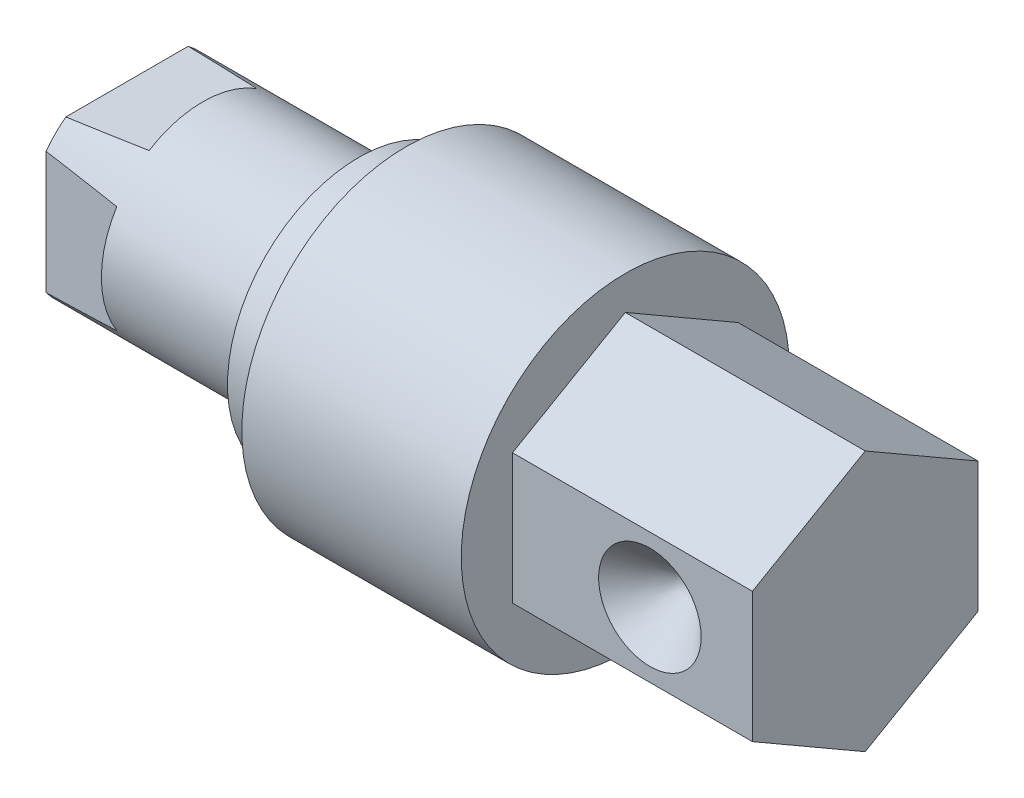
ISO-10303-21;
HEADER;
FILE_DESCRIPTION(('STEP AP214'),'2;1');
FILE_NAME('part.step','',(''),(''),'','','');
FILE_SCHEMA(('AUTOMOTIVE_DESIGN { 1 0 10303 214 1 1 1 1 }'));
ENDSEC;
DATA;
#1=APPLICATION_CONTEXT('core data for automotive mechanical design processes');
#2=APPLICATION_PROTOCOL_DEFINITION('international standard','automotive_design',2000,#1);
#3=PRODUCT_CONTEXT('',#1,'mechanical');
#4=PRODUCT('Part','Part','',(#3));
#5=PRODUCT_RELATED_PRODUCT_CATEGORY('part','',(#4));
#6=PRODUCT_DEFINITION_FORMATION('','',#4);
#7=PRODUCT_DEFINITION_CONTEXT('part definition',#1,'design');
#8=PRODUCT_DEFINITION('design','',#6,#7);
#9=PRODUCT_DEFINITION_SHAPE('','',#8);
#10=(LENGTH_UNIT() NAMED_UNIT(*) SI_UNIT(.MILLI.,.METRE.));
#11=(NAMED_UNIT(*) PLANE_ANGLE_UNIT() SI_UNIT($,.RADIAN.));
#12=(NAMED_UNIT(*) SI_UNIT($,.STERADIAN.) SOLID_ANGLE_UNIT());
#13=UNCERTAINTY_MEASURE_WITH_UNIT(LENGTH_MEASURE(1.E-05),#10,'distance_accuracy_value','');
#14=(GEOMETRIC_REPRESENTATION_CONTEXT(3) GLOBAL_UNCERTAINTY_ASSIGNED_CONTEXT((#13)) GLOBAL_UNIT_ASSIGNED_CONTEXT((#10,
#11,#12)) REPRESENTATION_CONTEXT('',''));
#15=CARTESIAN_POINT('',(0.,0.,0.));
#16=DIRECTION('',(0.,0.,1.));
#17=DIRECTION('',(1.,0.,0.));
#18=AXIS2_PLACEMENT_3D('',#15,#16,#17);
#19=CARTESIAN_POINT('',(-13.6,0.,0.));
#20=DIRECTION('',(-1.,0.,0.));
#21=DIRECTION('',(0.,0.,1.));
#22=AXIS2_PLACEMENT_3D('',#19,#20,#21);
#23=CYLINDRICAL_SURFACE('',#22,3.);
#24=CARTESIAN_POINT('',(-3.6,0.,0.));
#25=DIRECTION('',(-1.,0.,0.));
#26=DIRECTION('',(0.,0.,1.));
#27=AXIS2_PLACEMENT_3D('',#24,#25,#26);
#28=CIRCLE('',#27,3.);
#29=CARTESIAN_POINT('',(-3.6,0.,3.));
#30=VERTEX_POINT('',#29);
#31=EDGE_CURVE('P0_E11',#30,#30,#28,.T.);
#32=ORIENTED_EDGE('',*,*,#31,.T.);
#33=EDGE_LOOP('',(#32));
#34=FACE_BOUND('',#33,.T.);
#35=CARTESIAN_POINT('',(-13.6,0.,0.));
#36=DIRECTION('',(-1.,0.,0.));
#37=DIRECTION('',(0.,0.,1.));
#38=AXIS2_PLACEMENT_3D('',#35,#36,#37);
#39=CIRCLE('',#38,3.);
#40=CARTESIAN_POINT('',(-13.6,0.,3.));
#41=VERTEX_POINT('',#40);
#42=EDGE_CURVE('P0_E23',#41,#41,#39,.F.);
#43=ORIENTED_EDGE('',*,*,#42,.T.);
#44=EDGE_LOOP('',(#43));
#45=FACE_BOUND('',#44,.T.);
#46=ADVANCED_FACE('P0_F16',(#34,#45),#23,.T.);
#47=CARTESIAN_POINT('',(-3.6,0.,0.));
#48=DIRECTION('',(-1.,0.,0.));
#49=DIRECTION('',(0.,0.,1.));
#50=AXIS2_PLACEMENT_3D('',#47,#48,#49);
#51=PLANE('',#50);
#52=CARTESIAN_POINT('',(-3.6,-2.5,0.));
#53=CARTESIAN_POINT('',(-3.6,-2.49841699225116,-0.500094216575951));
#54=CARTESIAN_POINT('',(-3.6,-2.3097253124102,-0.956496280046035));
#55=CARTESIAN_POINT('',(-3.6,-2.12006183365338,-1.41524890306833));
#56=CARTESIAN_POINT('',(-3.6,-1.76775992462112,-1.7677269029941));
#57=CARTESIAN_POINT('',(-3.6,-1.41648835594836,-2.11917404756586));
#58=CARTESIAN_POINT('',(-3.6,-0.956706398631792,-2.30968776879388));
#59=CARTESIAN_POINT('',(-3.6,-0.497671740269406,-2.499891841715));
#60=CARTESIAN_POINT('',(-3.6,0.,-2.49999999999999));
#61=CARTESIAN_POINT('',(-3.6,0.496587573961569,-2.50010792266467));
#62=CARTESIAN_POINT('',(-3.6,0.956706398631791,-2.30968776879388));
#63=CARTESIAN_POINT('',(-3.6,1.41557313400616,-2.11978579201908));
#64=CARTESIAN_POINT('',(-3.6,1.76775992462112,-1.7677269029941));
#65=CARTESIAN_POINT('',(-3.6,2.11945156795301,-1.41616298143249));
#66=CARTESIAN_POINT('',(-3.6,2.30972531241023,-0.956496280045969));
#67=CARTESIAN_POINT('',(-3.6,2.4984152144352,-0.500655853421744));
#68=CARTESIAN_POINT('',(-3.6,2.5,0.));
#69=B_SPLINE_CURVE_WITH_KNOTS('',2,(#52,#53,#54,#55,#56,#57,#58,#59,#60,#61,#62,#63,#64,#65,#66,
#67,#68),.UNSPECIFIED.,.F.,.F.,(3,2,2,2,2,2,2,2,3),(0.,0.125,0.25,0.375,0.5,0.625,0.75,0.875,
1.),.UNSPECIFIED.);
#70=CARTESIAN_POINT('',(-3.6,-2.5,0.));
#71=VERTEX_POINT('',#70);
#72=CARTESIAN_POINT('',(-3.6,2.5,0.));
#73=VERTEX_POINT('',#72);
#74=EDGE_CURVE('P0_E27',#71,#73,#69,.T.);
#75=ORIENTED_EDGE('',*,*,#74,.F.);
#76=CARTESIAN_POINT('',(-3.6,2.5,0.));
#77=CARTESIAN_POINT('',(-3.6,2.49841699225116,0.500094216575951));
#78=CARTESIAN_POINT('',(-3.6,2.3097253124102,0.956496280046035));
#79=CARTESIAN_POINT('',(-3.6,2.12006183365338,1.41524890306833));
#80=CARTESIAN_POINT('',(-3.6,1.76775992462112,1.7677269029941));
#81=CARTESIAN_POINT('',(-3.6,1.41648835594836,2.11917404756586));
#82=CARTESIAN_POINT('',(-3.6,0.956706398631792,2.30968776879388));
#83=CARTESIAN_POINT('',(-3.6,0.497671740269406,2.499891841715));
#84=CARTESIAN_POINT('',(-3.6,0.,2.49999999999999));
#85=CARTESIAN_POINT('',(-3.6,-0.496587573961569,2.50010792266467));
#86=CARTESIAN_POINT('',(-3.6,-0.956706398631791,2.30968776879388));
#87=CARTESIAN_POINT('',(-3.6,-1.41557313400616,2.11978579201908));
#88=CARTESIAN_POINT('',(-3.6,-1.76775992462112,1.7677269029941));
#89=CARTESIAN_POINT('',(-3.6,-2.11945156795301,1.41616298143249));
#90=CARTESIAN_POINT('',(-3.6,-2.30972531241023,0.956496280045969));
#91=CARTESIAN_POINT('',(-3.6,-2.4984152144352,0.500655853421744));
#92=CARTESIAN_POINT('',(-3.6,-2.5,0.));
#93=B_SPLINE_CURVE_WITH_KNOTS('',2,(#76,#77,#78,#79,#80,#81,#82,#83,#84,#85,#86,#87,#88,#89,#90,
#91,#92),.UNSPECIFIED.,.F.,.F.,(3,2,2,2,2,2,2,2,3),(0.,0.125,0.25,0.375,0.5,0.625,0.75,0.875,
1.),.UNSPECIFIED.);
#94=EDGE_CURVE('P0_E32',#73,#71,#93,.T.);
#95=ORIENTED_EDGE('',*,*,#94,.F.);
#96=EDGE_LOOP('',(#75,#95));
#97=FACE_BOUND('',#96,.T.);
#98=ORIENTED_EDGE('',*,*,#31,.F.);
#99=EDGE_LOOP('',(#98));
#100=FACE_BOUND('',#99,.T.);
#101=ADVANCED_FACE('P0_F17',(#97,#100),#51,.F.);
#102=OPEN_SHELL('',(#46,#101));
#103=SHELL_BASED_SURFACE_MODEL('P0_B1',(#102));
#104=CARTESIAN_POINT('',(1.4,0.,0.));
#105=DIRECTION('',(1.,0.,0.));
#106=DIRECTION('',(0.,0.,-1.));
#107=AXIS2_PLACEMENT_3D('',#104,#105,#106);
#108=PLANE('',#107);
#109=CARTESIAN_POINT('',(1.4,0.,0.));
#110=DIRECTION('',(1.,0.,0.));
#111=DIRECTION('',(0.,0.,-1.));
#112=AXIS2_PLACEMENT_3D('',#109,#110,#111);
#113=CIRCLE('',#112,2.5);
#114=CARTESIAN_POINT('',(1.4,0.,-2.5));
#115=VERTEX_POINT('',#114);
#116=EDGE_CURVE('P1_E19',#115,#115,#113,.F.);
#117=ORIENTED_EDGE('',*,*,#116,.T.);
#118=EDGE_LOOP('',(#117));
#119=FACE_BOUND('',#118,.T.);
#120=ADVANCED_FACE('P1_F16',(#119),#108,.F.);
#121=CARTESIAN_POINT('',(-13.6,0.,0.));
#122=DIRECTION('',(1.,0.,0.));
#123=DIRECTION('',(0.,0.,-1.));
#124=AXIS2_PLACEMENT_3D('',#121,#122,#123);
#125=CYLINDRICAL_SURFACE('',#124,2.5);
#126=ORIENTED_EDGE('',*,*,#116,.F.);
#127=EDGE_LOOP('',(#126));
#128=FACE_BOUND('',#127,.T.);
#129=CARTESIAN_POINT('',(-13.6,0.,0.));
#130=DIRECTION('',(1.,0.,0.));
#131=DIRECTION('',(0.,0.,-1.));
#132=AXIS2_PLACEMENT_3D('',#129,#130,#131);
#133=CIRCLE('',#132,2.5);
#134=CARTESIAN_POINT('',(-13.6,0.,-2.5));
#135=VERTEX_POINT('',#134);
#136=EDGE_CURVE('P1_E165',#135,#135,#133,.F.);
#137=ORIENTED_EDGE('',*,*,#136,.T.);
#138=EDGE_LOOP('',(#137));
#139=FACE_BOUND('',#138,.T.);
#140=ADVANCED_FACE('P1_F377',(#128,#139),#125,.F.);
#141=CARTESIAN_POINT('',(-13.6,0.,0.));
#142=DIRECTION('',(1.,0.,0.));
#143=DIRECTION('',(0.,0.,-1.));
#144=AXIS2_PLACEMENT_3D('',#141,#142,#143);
#145=PLANE('',#144);
#146=ORIENTED_EDGE('',*,*,#136,.F.);
#147=EDGE_LOOP('',(#146));
#148=FACE_BOUND('',#147,.T.);
#149=CARTESIAN_POINT('',(-13.6,0.,0.));
#150=DIRECTION('',(1.,0.,0.));
#151=DIRECTION('',(0.,0.,-1.));
#152=AXIS2_PLACEMENT_3D('',#149,#150,#151);
#153=CIRCLE('',#152,4.95);
#154=CARTESIAN_POINT('',(-13.6,2.98328677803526,-3.95));
#155=VERTEX_POINT('',#154);
#156=CARTESIAN_POINT('',(-13.6,3.95,-2.98328677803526));
#157=VERTEX_POINT('',#156);
#158=EDGE_CURVE('P1_E169',#155,#157,#153,.T.);
#159=ORIENTED_EDGE('',*,*,#158,.F.);
#160=DIRECTION('',(0.,1.,0.));
#161=VECTOR('',#160,1.);
#162=CARTESIAN_POINT('',(-13.6,9.609618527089,-3.95));
#163=LINE('',#162,#161);
#164=CARTESIAN_POINT('',(-13.6,-2.98328677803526,-3.95));
#165=VERTEX_POINT('',#164);
#166=EDGE_CURVE('P1_E183',#155,#165,#163,.F.);
#167=ORIENTED_EDGE('',*,*,#166,.T.);
#168=CARTESIAN_POINT('',(-13.6,0.,0.));
#169=DIRECTION('',(1.,0.,0.));
#170=DIRECTION('',(0.,0.,-1.));
#171=AXIS2_PLACEMENT_3D('',#168,#169,#170);
#172=CIRCLE('',#171,4.95);
#173=CARTESIAN_POINT('',(-13.6,-3.95000000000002,-2.98328677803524));
#174=VERTEX_POINT('',#173);
#175=EDGE_CURVE('P1_E171',#174,#165,#172,.T.);
#176=ORIENTED_EDGE('',*,*,#175,.F.);
#177=DIRECTION('',(0.,0.,1.));
#178=VECTOR('',#177,1.);
#179=CARTESIAN_POINT('',(-13.6,-3.95000000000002,9.6));
#180=LINE('',#179,#178);
#181=CARTESIAN_POINT('',(-13.6,-3.95000000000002,2.98328677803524));
#182=VERTEX_POINT('',#181);
#183=EDGE_CURVE('P1_E178',#174,#182,#180,.T.);
#184=ORIENTED_EDGE('',*,*,#183,.T.);
#185=CARTESIAN_POINT('',(-13.6,0.,0.));
#186=DIRECTION('',(1.,0.,0.));
#187=DIRECTION('',(0.,0.,-1.));
#188=AXIS2_PLACEMENT_3D('',#185,#186,#187);
#189=CIRCLE('',#188,4.95);
#190=CARTESIAN_POINT('',(-13.6,-2.98328677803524,3.95000000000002));
#191=VERTEX_POINT('',#190);
#192=EDGE_CURVE('P1_E133',#191,#182,#189,.T.);
#193=ORIENTED_EDGE('',*,*,#192,.F.);
#194=DIRECTION('',(0.,1.,0.));
#195=VECTOR('',#194,1.);
#196=CARTESIAN_POINT('',(-13.6,9.609618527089,3.95000000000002));
#197=LINE('',#196,#195);
#198=CARTESIAN_POINT('',(-13.6,2.98328677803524,3.95000000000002));
#199=VERTEX_POINT('',#198);
#200=EDGE_CURVE('P1_E135',#191,#199,#197,.T.);
#201=ORIENTED_EDGE('',*,*,#200,.T.);
#202=CARTESIAN_POINT('',(-13.6,0.,0.));
#203=DIRECTION('',(1.,0.,0.));
#204=DIRECTION('',(0.,0.,-1.));
#205=AXIS2_PLACEMENT_3D('',#202,#203,#204);
#206=CIRCLE('',#205,4.95);
#207=CARTESIAN_POINT('',(-13.6,3.95,2.98328677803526));
#208=VERTEX_POINT('',#207);
#209=EDGE_CURVE('P1_E121',#208,#199,#206,.T.);
#210=ORIENTED_EDGE('',*,*,#209,.F.);
#211=DIRECTION('',(0.,0.,1.));
#212=VECTOR('',#211,1.);
#213=CARTESIAN_POINT('',(-13.6,3.95,9.6));
#214=LINE('',#213,#212);
#215=EDGE_CURVE('P1_E221',#208,#157,#214,.F.);
#216=ORIENTED_EDGE('',*,*,#215,.T.);
#217=EDGE_LOOP('',(#159,#167,#176,#184,#193,#201,#210,#216));
#218=FACE_BOUND('',#217,.T.);
#219=ADVANCED_FACE('P1_F136',(#148,#218),#145,.F.);
#220=CARTESIAN_POINT('',(-9.9,9.609618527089,-4.2));
#221=DIRECTION('',(1.,0.,0.));
#222=DIRECTION('',(0.,0.,-1.));
#223=AXIS2_PLACEMENT_3D('',#220,#221,#222);
#224=PLANE('',#223);
#225=DIRECTION('',(0.,1.,0.));
#226=VECTOR('',#225,1.);
#227=CARTESIAN_POINT('',(-9.9,9.609618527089,-4.19999999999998));
#228=LINE('',#227,#226);
#229=CARTESIAN_POINT('',(-9.9,-2.61963737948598,-4.19999999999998));
#230=VERTEX_POINT('',#229);
#231=CARTESIAN_POINT('',(-9.9,2.61963737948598,-4.19999999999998));
#232=VERTEX_POINT('',#231);
#233=EDGE_CURVE('P1_E164',#230,#232,#228,.T.);
#234=ORIENTED_EDGE('',*,*,#233,.T.);
#235=CARTESIAN_POINT('',(-9.9,0.,0.));
#236=DIRECTION('',(1.,0.,0.));
#237=DIRECTION('',(0.,0.,-1.));
#238=AXIS2_PLACEMENT_3D('',#235,#236,#237);
#239=CIRCLE('',#238,4.95);
#240=EDGE_CURVE('P1_E161',#230,#232,#239,.T.);
#241=ORIENTED_EDGE('',*,*,#240,.F.);
#242=EDGE_LOOP('',(#234,#241));
#243=FACE_BOUND('',#242,.T.);
#244=ADVANCED_FACE('P1_F371',(#243),#224,.F.);
#245=CARTESIAN_POINT('',(-9.9,4.2,9.6));
#246=DIRECTION('',(1.,0.,0.));
#247=DIRECTION('',(0.,0.,-1.));
#248=AXIS2_PLACEMENT_3D('',#245,#246,#247);
#249=PLANE('',#248);
#250=DIRECTION('',(0.,0.,1.));
#251=VECTOR('',#250,1.);
#252=CARTESIAN_POINT('',(-9.9,4.19999999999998,9.6));
#253=LINE('',#252,#251);
#254=CARTESIAN_POINT('',(-9.9,4.19999999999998,-2.61963737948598));
#255=VERTEX_POINT('',#254);
#256=CARTESIAN_POINT('',(-9.9,4.19999999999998,2.61963737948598));
#257=VERTEX_POINT('',#256);
#258=EDGE_CURVE('P1_E168',#255,#257,#253,.T.);
#259=ORIENTED_EDGE('',*,*,#258,.T.);
#260=CARTESIAN_POINT('',(-9.9,0.,0.));
#261=DIRECTION('',(1.,0.,0.));
#262=DIRECTION('',(0.,0.,-1.));
#263=AXIS2_PLACEMENT_3D('',#260,#261,#262);
#264=CIRCLE('',#263,4.95);
#265=EDGE_CURVE('P1_E150',#255,#257,#264,.T.);
#266=ORIENTED_EDGE('',*,*,#265,.F.);
#267=EDGE_LOOP('',(#259,#266));
#268=FACE_BOUND('',#267,.T.);
#269=ADVANCED_FACE('P1_F367',(#268),#249,.F.);
#270=CARTESIAN_POINT('',(-13.6,3.95,9.6));
#271=DIRECTION('',(0.067413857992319,-0.997725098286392,0.));
#272=DIRECTION('',(0.997725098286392,0.067413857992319,0.));
#273=AXIS2_PLACEMENT_3D('',#270,#271,#272);
#274=PLANE('',#273);
#275=ORIENTED_EDGE('',*,*,#215,.F.);
#276=CARTESIAN_POINT('',(-72.0600000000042,0.,0.));
#277=DIRECTION('',(0.067413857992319,-0.997725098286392,0.));
#278=DIRECTION('',(0.997725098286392,0.067413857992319,0.));
#279=AXIS2_PLACEMENT_3D('',#276,#277,#278);
#280=ELLIPSE('',#279,73.4270392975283,4.95);
#281=EDGE_CURVE('P1_E132',#257,#208,#280,.T.);
#282=ORIENTED_EDGE('',*,*,#281,.F.);
#283=ORIENTED_EDGE('',*,*,#258,.F.);
#284=CARTESIAN_POINT('',(-72.0600000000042,0.,0.));
#285=DIRECTION('',(0.067413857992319,-0.997725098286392,0.));
#286=DIRECTION('',(0.997725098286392,0.067413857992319,0.));
#287=AXIS2_PLACEMENT_3D('',#284,#285,#286);
#288=ELLIPSE('',#287,73.4270392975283,4.95);
#289=EDGE_CURVE('P1_E155',#157,#255,#288,.T.);
#290=ORIENTED_EDGE('',*,*,#289,.F.);
#291=EDGE_LOOP('',(#275,#282,#283,#290));
#292=FACE_BOUND('',#291,.T.);
#293=ADVANCED_FACE('P1_F363',(#292),#274,.F.);
#294=CARTESIAN_POINT('',(-9.9,9.609618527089,4.95));
#295=DIRECTION('',(1.,0.,0.));
#296=DIRECTION('',(0.,0.,-1.));
#297=AXIS2_PLACEMENT_3D('',#294,#295,#296);
#298=PLANE('',#297);
#299=DIRECTION('',(0.,1.,0.));
#300=VECTOR('',#299,1.);
#301=CARTESIAN_POINT('',(-9.9,9.609618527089,4.2));
#302=LINE('',#301,#300);
#303=CARTESIAN_POINT('',(-9.9,2.61963737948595,4.2));
#304=VERTEX_POINT('',#303);
#305=CARTESIAN_POINT('',(-9.9,-2.61963737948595,4.2));
#306=VERTEX_POINT('',#305);
#307=EDGE_CURVE('P1_E142',#304,#306,#302,.F.);
#308=ORIENTED_EDGE('',*,*,#307,.T.);
#309=CARTESIAN_POINT('',(-9.9,0.,0.));
#310=DIRECTION('',(1.,0.,0.));
#311=DIRECTION('',(0.,0.,-1.));
#312=AXIS2_PLACEMENT_3D('',#309,#310,#311);
#313=CIRCLE('',#312,4.95);
#314=EDGE_CURVE('P1_E146',#304,#306,#313,.T.);
#315=ORIENTED_EDGE('',*,*,#314,.F.);
#316=EDGE_LOOP('',(#308,#315));
#317=FACE_BOUND('',#316,.T.);
#318=ADVANCED_FACE('P1_F360',(#317),#298,.F.);
#319=CARTESIAN_POINT('',(-9.9,9.609618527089,4.2));
#320=DIRECTION('',(0.067413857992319,0.,-0.997725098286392));
#321=DIRECTION('',(-0.997725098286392,0.,-0.067413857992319));
#322=AXIS2_PLACEMENT_3D('',#319,#320,#321);
#323=PLANE('',#322);
#324=ORIENTED_EDGE('',*,*,#200,.F.);
#325=CARTESIAN_POINT('',(-72.0600000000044,0.,0.));
#326=DIRECTION('',(0.067413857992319,0.,-0.997725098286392));
#327=DIRECTION('',(0.997725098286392,0.,0.067413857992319));
#328=AXIS2_PLACEMENT_3D('',#325,#326,#327);
#329=ELLIPSE('',#328,73.4270392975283,4.95);
#330=EDGE_CURVE('P1_E148',#306,#191,#329,.T.);
#331=ORIENTED_EDGE('',*,*,#330,.F.);
#332=ORIENTED_EDGE('',*,*,#307,.F.);
#333=CARTESIAN_POINT('',(-72.0600000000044,0.,0.));
#334=DIRECTION('',(0.067413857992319,0.,-0.997725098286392));
#335=DIRECTION('',(0.997725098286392,0.,0.067413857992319));
#336=AXIS2_PLACEMENT_3D('',#333,#334,#335);
#337=ELLIPSE('',#336,73.4270392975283,4.95);
#338=EDGE_CURVE('P1_E129',#199,#304,#337,.T.);
#339=ORIENTED_EDGE('',*,*,#338,.F.);
#340=EDGE_LOOP('',(#324,#331,#332,#339));
#341=FACE_BOUND('',#340,.T.);
#342=ADVANCED_FACE('P1_F144',(#341),#323,.F.);
#343=CARTESIAN_POINT('',(-9.9,-4.95,9.6));
#344=DIRECTION('',(1.,0.,0.));
#345=DIRECTION('',(0.,0.,-1.));
#346=AXIS2_PLACEMENT_3D('',#343,#344,#345);
#347=PLANE('',#346);
#348=DIRECTION('',(0.,0.,1.));
#349=VECTOR('',#348,1.);
#350=CARTESIAN_POINT('',(-9.9,-4.2,9.6));
#351=LINE('',#350,#349);
#352=CARTESIAN_POINT('',(-9.9,-4.2,2.61963737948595));
#353=VERTEX_POINT('',#352);
#354=CARTESIAN_POINT('',(-9.9,-4.2,-2.61963737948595));
#355=VERTEX_POINT('',#354);
#356=EDGE_CURVE('P1_E141',#353,#355,#351,.F.);
#357=ORIENTED_EDGE('',*,*,#356,.T.);
#358=CARTESIAN_POINT('',(-9.9,0.,0.));
#359=DIRECTION('',(1.,0.,0.));
#360=DIRECTION('',(0.,0.,-1.));
#361=AXIS2_PLACEMENT_3D('',#358,#359,#360);
#362=CIRCLE('',#361,4.95);
#363=EDGE_CURVE('P1_E187',#353,#355,#362,.T.);
#364=ORIENTED_EDGE('',*,*,#363,.F.);
#365=EDGE_LOOP('',(#357,#364));
#366=FACE_BOUND('',#365,.T.);
#367=ADVANCED_FACE('P1_F354',(#366),#347,.F.);
#368=CARTESIAN_POINT('',(-9.9,-4.2,9.6));
#369=DIRECTION('',(0.067413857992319,0.997725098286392,0.));
#370=DIRECTION('',(-0.997725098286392,0.067413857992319,0.));
#371=AXIS2_PLACEMENT_3D('',#368,#369,#370);
#372=PLANE('',#371);
#373=CARTESIAN_POINT('',(-72.0600000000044,0.,0.));
#374=DIRECTION('',(0.067413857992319,0.997725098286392,0.));
#375=DIRECTION('',(0.997725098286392,-0.067413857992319,0.));
#376=AXIS2_PLACEMENT_3D('',#373,#374,#375);
#377=ELLIPSE('',#376,73.4270392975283,4.95);
#378=EDGE_CURVE('P1_E189',#355,#174,#377,.T.);
#379=ORIENTED_EDGE('',*,*,#378,.F.);
#380=ORIENTED_EDGE('',*,*,#356,.F.);
#381=CARTESIAN_POINT('',(-72.0600000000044,0.,0.));
#382=DIRECTION('',(0.067413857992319,0.997725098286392,0.));
#383=DIRECTION('',(0.997725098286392,-0.067413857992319,0.));
#384=AXIS2_PLACEMENT_3D('',#381,#382,#383);
#385=ELLIPSE('',#384,73.4270392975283,4.95);
#386=EDGE_CURVE('P1_E176',#182,#353,#385,.T.);
#387=ORIENTED_EDGE('',*,*,#386,.F.);
#388=ORIENTED_EDGE('',*,*,#183,.F.);
#389=EDGE_LOOP('',(#379,#380,#387,#388));
#390=FACE_BOUND('',#389,.T.);
#391=ADVANCED_FACE('P1_F185',(#390),#372,.F.);
#392=CARTESIAN_POINT('',(-13.6,9.609618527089,-3.95));
#393=DIRECTION('',(0.067413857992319,0.,0.997725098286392));
#394=DIRECTION('',(0.997725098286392,0.,-0.067413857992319));
#395=AXIS2_PLACEMENT_3D('',#392,#393,#394);
#396=PLANE('',#395);
#397=ORIENTED_EDGE('',*,*,#233,.F.);
#398=CARTESIAN_POINT('',(-72.0600000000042,0.,0.));
#399=DIRECTION('',(0.067413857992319,0.,0.997725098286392));
#400=DIRECTION('',(0.997725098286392,0.,-0.067413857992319));
#401=AXIS2_PLACEMENT_3D('',#398,#399,#400);
#402=ELLIPSE('',#401,73.4270392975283,4.95);
#403=EDGE_CURVE('P1_E193',#165,#230,#402,.T.);
#404=ORIENTED_EDGE('',*,*,#403,.F.);
#405=ORIENTED_EDGE('',*,*,#166,.F.);
#406=CARTESIAN_POINT('',(-72.0600000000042,0.,0.));
#407=DIRECTION('',(0.067413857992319,0.,0.997725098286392));
#408=DIRECTION('',(0.997725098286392,0.,-0.067413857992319));
#409=AXIS2_PLACEMENT_3D('',#406,#407,#408);
#410=ELLIPSE('',#409,73.4270392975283,4.95);
#411=EDGE_CURVE('P1_E158',#232,#155,#410,.T.);
#412=ORIENTED_EDGE('',*,*,#411,.F.);
#413=EDGE_LOOP('',(#397,#404,#405,#412));
#414=FACE_BOUND('',#413,.T.);
#415=ADVANCED_FACE('P1_F347',(#414),#396,.F.);
#416=CARTESIAN_POINT('',(-15.4,0.,0.));
#417=DIRECTION('',(1.,0.,0.));
#418=DIRECTION('',(0.,0.,-1.));
#419=AXIS2_PLACEMENT_3D('',#416,#417,#418);
#420=CYLINDRICAL_SURFACE('',#419,4.95);
#421=CARTESIAN_POINT('',(-2.3,0.,0.));
#422=DIRECTION('',(1.,0.,0.));
#423=DIRECTION('',(0.,0.,-1.));
#424=AXIS2_PLACEMENT_3D('',#421,#422,#423);
#425=CIRCLE('',#424,4.95);
#426=CARTESIAN_POINT('',(-2.3,0.,-4.95));
#427=VERTEX_POINT('',#426);
#428=EDGE_CURVE('P1_E196',#427,#427,#425,.F.);
#429=ORIENTED_EDGE('',*,*,#428,.T.);
#430=EDGE_LOOP('',(#429));
#431=FACE_BOUND('',#430,.T.);
#432=ORIENTED_EDGE('',*,*,#175,.T.);
#433=ORIENTED_EDGE('',*,*,#403,.T.);
#434=ORIENTED_EDGE('',*,*,#240,.T.);
#435=ORIENTED_EDGE('',*,*,#411,.T.);
#436=ORIENTED_EDGE('',*,*,#158,.T.);
#437=ORIENTED_EDGE('',*,*,#289,.T.);
#438=ORIENTED_EDGE('',*,*,#265,.T.);
#439=ORIENTED_EDGE('',*,*,#281,.T.);
#440=ORIENTED_EDGE('',*,*,#209,.T.);
#441=ORIENTED_EDGE('',*,*,#338,.T.);
#442=ORIENTED_EDGE('',*,*,#314,.T.);
#443=ORIENTED_EDGE('',*,*,#330,.T.);
#444=ORIENTED_EDGE('',*,*,#192,.T.);
#445=ORIENTED_EDGE('',*,*,#386,.T.);
#446=ORIENTED_EDGE('',*,*,#363,.T.);
#447=ORIENTED_EDGE('',*,*,#378,.T.);
#448=EDGE_LOOP('',(#432,#433,#434,#435,#436,#437,#438,#439,#440,#441,#442,#443,#444,#445,#446,#447));
#449=FACE_BOUND('',#448,.T.);
#450=ADVANCED_FACE('P1_F126',(#431,#449),#420,.T.);
#451=CARTESIAN_POINT('',(-2.3,0.,0.));
#452=DIRECTION('',(1.,0.,0.));
#453=DIRECTION('',(0.,0.,-1.));
#454=AXIS2_PLACEMENT_3D('',#451,#452,#453);
#455=PLANE('',#454);
#456=ORIENTED_EDGE('',*,*,#428,.F.);
#457=EDGE_LOOP('',(#456));
#458=FACE_BOUND('',#457,.T.);
#459=CARTESIAN_POINT('',(-2.3,0.,0.));
#460=DIRECTION('',(1.,0.,0.));
#461=DIRECTION('',(0.,0.,-1.));
#462=AXIS2_PLACEMENT_3D('',#459,#460,#461);
#463=CIRCLE('',#462,6.4);
#464=CARTESIAN_POINT('',(-2.3,0.,-6.4));
#465=VERTEX_POINT('',#464);
#466=EDGE_CURVE('P1_E199',#465,#465,#463,.T.);
#467=ORIENTED_EDGE('',*,*,#466,.F.);
#468=EDGE_LOOP('',(#467));
#469=FACE_BOUND('',#468,.T.);
#470=ADVANCED_FACE('P1_F340',(#458,#469),#455,.F.);
#471=CARTESIAN_POINT('',(17.4,0.,-5.50000000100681));
#472=DIRECTION('',(0.,0.,-1.));
#473=DIRECTION('',(-1.,0.,0.));
#474=AXIS2_PLACEMENT_3D('',#471,#472,#473);
#475=CONICAL_SURFACE('',#474,2.49999999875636,0.785398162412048);
#476=CARTESIAN_POINT('',(17.3999999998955,0.,-2.99999999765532));
#477=VERTEX_POINT('',#476);
#478=VERTEX_LOOP('',#477);
#479=FACE_BOUND('',#478,.T.);
#480=CARTESIAN_POINT('',(17.4,0.,-5.5000000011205));
#481=DIRECTION('',(0.,0.,-1.));
#482=DIRECTION('',(-1.,0.,0.));
#483=AXIS2_PLACEMENT_3D('',#480,#481,#482);
#484=CIRCLE('',#483,2.49999999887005);
#485=CARTESIAN_POINT('',(14.90000000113,0.,-5.5000000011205));
#486=VERTEX_POINT('',#485);
#487=EDGE_CURVE('P1_E203',#486,#486,#484,.T.);
#488=ORIENTED_EDGE('',*,*,#487,.T.);
#489=EDGE_LOOP('',(#488));
#490=FACE_BOUND('',#489,.T.);
#491=ADVANCED_FACE('P1_F336',(#479,#490),#475,.F.);
#492=CARTESIAN_POINT('',(17.4,0.,5.50000000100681));
#493=DIRECTION('',(0.,0.,1.));
#494=DIRECTION('',(1.,0.,0.));
#495=AXIS2_PLACEMENT_3D('',#492,#493,#494);
#496=CONICAL_SURFACE('',#495,2.49999999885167,0.785398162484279);
#497=CARTESIAN_POINT('',(17.400000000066,0.,2.99999999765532));
#498=VERTEX_POINT('',#497);
#499=VERTEX_LOOP('',#498);
#500=FACE_BOUND('',#499,.T.);
#501=CARTESIAN_POINT('',(17.4,0.,5.5000000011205));
#502=DIRECTION('',(0.,0.,1.));
#503=DIRECTION('',(1.,0.,0.));
#504=AXIS2_PLACEMENT_3D('',#501,#502,#503);
#505=CIRCLE('',#504,2.49999999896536);
#506=CARTESIAN_POINT('',(19.8999999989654,0.,5.5000000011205));
#507=VERTEX_POINT('',#506);
#508=EDGE_CURVE('P1_E207',#507,#507,#505,.T.);
#509=ORIENTED_EDGE('',*,*,#508,.T.);
#510=EDGE_LOOP('',(#509));
#511=FACE_BOUND('',#510,.T.);
#512=ADVANCED_FACE('P1_F329',(#500,#511),#496,.F.);
#513=CARTESIAN_POINT('',(22.4,0.,0.));
#514=DIRECTION('',(1.,0.,0.));
#515=DIRECTION('',(0.,0.,-1.));
#516=AXIS2_PLACEMENT_3D('',#513,#514,#515);
#517=PLANE('',#516);
#518=DIRECTION('',(0.,0.500000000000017,0.866025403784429));
#519=VECTOR('',#518,1.);
#520=CARTESIAN_POINT('',(22.4,-3.175426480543,5.5));
#521=LINE('',#520,#519);
#522=CARTESIAN_POINT('',(22.4,-3.175426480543,5.5));
#523=VERTEX_POINT('',#522);
#524=CARTESIAN_POINT('',(22.4,-6.35085296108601,0.));
#525=VERTEX_POINT('',#524);
#526=EDGE_CURVE('P1_E234',#523,#525,#521,.F.);
#527=ORIENTED_EDGE('',*,*,#526,.T.);
#528=DIRECTION('',(0.,-0.500000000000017,0.866025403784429));
#529=VECTOR('',#528,1.);
#530=CARTESIAN_POINT('',(22.4,-6.350852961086,0.));
#531=LINE('',#530,#529);
#532=CARTESIAN_POINT('',(22.4,-3.17542648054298,-5.49999999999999));
#533=VERTEX_POINT('',#532);
#534=EDGE_CURVE('P1_E229',#525,#533,#531,.F.);
#535=ORIENTED_EDGE('',*,*,#534,.T.);
#536=DIRECTION('',(0.,1.,0.));
#537=VECTOR('',#536,1.);
#538=CARTESIAN_POINT('',(22.4,-3.175426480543,-5.5));
#539=LINE('',#538,#537);
#540=CARTESIAN_POINT('',(22.4,3.175426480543,-5.5));
#541=VERTEX_POINT('',#540);
#542=EDGE_CURVE('P1_E202',#533,#541,#539,.T.);
#543=ORIENTED_EDGE('',*,*,#542,.T.);
#544=DIRECTION('',(0.,-0.500000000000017,-0.866025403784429));
#545=VECTOR('',#544,1.);
#546=CARTESIAN_POINT('',(22.4,3.175426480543,-5.5));
#547=LINE('',#546,#545);
#548=CARTESIAN_POINT('',(22.4,6.35085296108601,0.));
#549=VERTEX_POINT('',#548);
#550=EDGE_CURVE('P1_E216',#541,#549,#547,.F.);
#551=ORIENTED_EDGE('',*,*,#550,.T.);
#552=DIRECTION('',(0.,0.500000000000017,-0.866025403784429));
#553=VECTOR('',#552,1.);
#554=CARTESIAN_POINT('',(22.4,6.350852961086,0.));
#555=LINE('',#554,#553);
#556=CARTESIAN_POINT('',(22.4,3.17542648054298,5.49999999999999));
#557=VERTEX_POINT('',#556);
#558=EDGE_CURVE('P1_E242',#549,#557,#555,.F.);
#559=ORIENTED_EDGE('',*,*,#558,.T.);
#560=DIRECTION('',(0.,1.,0.));
#561=VECTOR('',#560,1.);
#562=CARTESIAN_POINT('',(22.4,3.175426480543,5.5));
#563=LINE('',#562,#561);
#564=EDGE_CURVE('P1_E211',#557,#523,#563,.F.);
#565=ORIENTED_EDGE('',*,*,#564,.T.);
#566=EDGE_LOOP('',(#527,#535,#543,#551,#559,#565));
#567=FACE_BOUND('',#566,.T.);
#568=ADVANCED_FACE('P1_F320',(#567),#517,.T.);
#569=CARTESIAN_POINT('',(-15.4,0.,0.));
#570=DIRECTION('',(1.,0.,0.));
#571=DIRECTION('',(0.,0.,-1.));
#572=AXIS2_PLACEMENT_3D('',#569,#570,#571);
#573=CYLINDRICAL_SURFACE('',#572,6.4);
#574=ORIENTED_EDGE('',*,*,#466,.T.);
#575=EDGE_LOOP('',(#574));
#576=FACE_BOUND('',#575,.T.);
#577=CARTESIAN_POINT('',(0.,0.,0.));
#578=DIRECTION('',(1.,0.,0.));
#579=DIRECTION('',(0.,0.,-1.));
#580=AXIS2_PLACEMENT_3D('',#577,#578,#579);
#581=CIRCLE('',#580,6.4);
#582=CARTESIAN_POINT('',(0.,0.,-6.4));
#583=VERTEX_POINT('',#582);
#584=EDGE_CURVE('P1_E212',#583,#583,#581,.F.);
#585=ORIENTED_EDGE('',*,*,#584,.T.);
#586=EDGE_LOOP('',(#585));
#587=FACE_BOUND('',#586,.T.);
#588=ADVANCED_FACE('P1_F318',(#576,#587),#573,.T.);
#589=CARTESIAN_POINT('',(10.7,-3.175426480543,-5.5));
#590=DIRECTION('',(0.,0.,1.));
#591=DIRECTION('',(1.,0.,0.));
#592=AXIS2_PLACEMENT_3D('',#589,#590,#591);
#593=PLANE('',#592);
#594=ORIENTED_EDGE('',*,*,#487,.F.);
#595=EDGE_LOOP('',(#594));
#596=FACE_BOUND('',#595,.T.);
#597=DIRECTION('',(1.,0.,0.));
#598=VECTOR('',#597,1.);
#599=CARTESIAN_POINT('',(10.7,-3.17542648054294,-5.49999999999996));
#600=LINE('',#599,#598);
#601=CARTESIAN_POINT('',(10.7,-3.17542648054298,-5.49999999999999));
#602=VERTEX_POINT('',#601);
#603=EDGE_CURVE('P1_E206',#533,#602,#600,.F.);
#604=ORIENTED_EDGE('',*,*,#603,.T.);
#605=DIRECTION('',(0.,1.,0.));
#606=VECTOR('',#605,1.);
#607=CARTESIAN_POINT('',(10.7,0.,-5.5));
#608=LINE('',#607,#606);
#609=CARTESIAN_POINT('',(10.7,3.175426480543,-5.5));
#610=VERTEX_POINT('',#609);
#611=EDGE_CURVE('P1_E215',#610,#602,#608,.F.);
#612=ORIENTED_EDGE('',*,*,#611,.F.);
#613=DIRECTION('',(1.,0.,0.));
#614=VECTOR('',#613,1.);
#615=CARTESIAN_POINT('',(10.7,3.175426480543,-5.5));
#616=LINE('',#615,#614);
#617=EDGE_CURVE('P1_E246',#610,#541,#616,.T.);
#618=ORIENTED_EDGE('',*,*,#617,.T.);
#619=ORIENTED_EDGE('',*,*,#542,.F.);
#620=EDGE_LOOP('',(#604,#612,#618,#619));
#621=FACE_BOUND('',#620,.T.);
#622=ADVANCED_FACE('P1_F274',(#596,#621),#593,.F.);
#623=CARTESIAN_POINT('',(10.7,-6.350852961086,0.));
#624=DIRECTION('',(0.,0.866025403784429,0.500000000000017));
#625=DIRECTION('',(0.,-0.500000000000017,0.866025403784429));
#626=AXIS2_PLACEMENT_3D('',#623,#624,#625);
#627=PLANE('',#626);
#628=DIRECTION('',(1.,0.,0.));
#629=VECTOR('',#628,1.);
#630=CARTESIAN_POINT('',(10.7,-6.35085296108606,0.));
#631=LINE('',#630,#629);
#632=CARTESIAN_POINT('',(10.7,-6.35085296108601,0.));
#633=VERTEX_POINT('',#632);
#634=EDGE_CURVE('P1_E232',#525,#633,#631,.F.);
#635=ORIENTED_EDGE('',*,*,#634,.T.);
#636=DIRECTION('',(0.,-0.500000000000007,0.866025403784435));
#637=VECTOR('',#636,1.);
#638=CARTESIAN_POINT('',(10.7,-3.175426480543,-5.5));
#639=LINE('',#638,#637);
#640=EDGE_CURVE('P1_E253',#602,#633,#639,.T.);
#641=ORIENTED_EDGE('',*,*,#640,.F.);
#642=ORIENTED_EDGE('',*,*,#603,.F.);
#643=ORIENTED_EDGE('',*,*,#534,.F.);
#644=EDGE_LOOP('',(#635,#641,#642,#643));
#645=FACE_BOUND('',#644,.T.);
#646=ADVANCED_FACE('P1_F278',(#645),#627,.F.);
#647=CARTESIAN_POINT('',(10.7,-3.175426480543,5.5));
#648=DIRECTION('',(0.,0.866025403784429,-0.500000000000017));
#649=DIRECTION('',(0.,0.500000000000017,0.866025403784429));
#650=AXIS2_PLACEMENT_3D('',#647,#648,#649);
#651=PLANE('',#650);
#652=DIRECTION('',(-1.,0.,0.));
#653=VECTOR('',#652,1.);
#654=CARTESIAN_POINT('',(10.7,-3.175426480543,5.5));
#655=LINE('',#654,#653);
#656=CARTESIAN_POINT('',(10.7,-3.175426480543,5.5));
#657=VERTEX_POINT('',#656);
#658=EDGE_CURVE('P1_E237',#523,#657,#655,.T.);
#659=ORIENTED_EDGE('',*,*,#658,.T.);
#660=DIRECTION('',(0.,0.500000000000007,0.866025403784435));
#661=VECTOR('',#660,1.);
#662=CARTESIAN_POINT('',(10.7,-6.350852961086,0.));
#663=LINE('',#662,#661);
#664=EDGE_CURVE('P1_E256',#633,#657,#663,.T.);
#665=ORIENTED_EDGE('',*,*,#664,.F.);
#666=ORIENTED_EDGE('',*,*,#634,.F.);
#667=ORIENTED_EDGE('',*,*,#526,.F.);
#668=EDGE_LOOP('',(#659,#665,#666,#667));
#669=FACE_BOUND('',#668,.T.);
#670=ADVANCED_FACE('P1_F283',(#669),#651,.F.);
#671=CARTESIAN_POINT('',(10.7,3.175426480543,5.5));
#672=DIRECTION('',(0.,0.,-1.));
#673=DIRECTION('',(-1.,0.,0.));
#674=AXIS2_PLACEMENT_3D('',#671,#672,#673);
#675=PLANE('',#674);
#676=ORIENTED_EDGE('',*,*,#508,.F.);
#677=EDGE_LOOP('',(#676));
#678=FACE_BOUND('',#677,.T.);
#679=DIRECTION('',(1.,0.,0.));
#680=VECTOR('',#679,1.);
#681=CARTESIAN_POINT('',(10.7,3.17542648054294,5.49999999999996));
#682=LINE('',#681,#680);
#683=CARTESIAN_POINT('',(10.7,3.17542648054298,5.49999999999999));
#684=VERTEX_POINT('',#683);
#685=EDGE_CURVE('P1_E210',#557,#684,#682,.F.);
#686=ORIENTED_EDGE('',*,*,#685,.T.);
#687=DIRECTION('',(0.,1.,0.));
#688=VECTOR('',#687,1.);
#689=CARTESIAN_POINT('',(10.7,0.,5.5));
#690=LINE('',#689,#688);
#691=EDGE_CURVE('P1_E259',#657,#684,#690,.T.);
#692=ORIENTED_EDGE('',*,*,#691,.F.);
#693=ORIENTED_EDGE('',*,*,#658,.F.);
#694=ORIENTED_EDGE('',*,*,#564,.F.);
#695=EDGE_LOOP('',(#686,#692,#693,#694));
#696=FACE_BOUND('',#695,.T.);
#697=ADVANCED_FACE('P1_F286',(#678,#696),#675,.F.);
#698=CARTESIAN_POINT('',(10.7,6.350852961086,0.));
#699=DIRECTION('',(0.,-0.866025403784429,-0.500000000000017));
#700=DIRECTION('',(0.,0.500000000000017,-0.866025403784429));
#701=AXIS2_PLACEMENT_3D('',#698,#699,#700);
#702=PLANE('',#701);
#703=DIRECTION('',(1.,0.,0.));
#704=VECTOR('',#703,1.);
#705=CARTESIAN_POINT('',(10.7,6.35085296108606,0.));
#706=LINE('',#705,#704);
#707=CARTESIAN_POINT('',(10.7,6.35085296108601,0.));
#708=VERTEX_POINT('',#707);
#709=EDGE_CURVE('P1_E34',#549,#708,#706,.F.);
#710=ORIENTED_EDGE('',*,*,#709,.T.);
#711=DIRECTION('',(0.,0.500000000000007,-0.866025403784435));
#712=VECTOR('',#711,1.);
#713=CARTESIAN_POINT('',(10.7,3.175426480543,5.5));
#714=LINE('',#713,#712);
#715=EDGE_CURVE('P1_E262',#684,#708,#714,.T.);
#716=ORIENTED_EDGE('',*,*,#715,.F.);
#717=ORIENTED_EDGE('',*,*,#685,.F.);
#718=ORIENTED_EDGE('',*,*,#558,.F.);
#719=EDGE_LOOP('',(#710,#716,#717,#718));
#720=FACE_BOUND('',#719,.T.);
#721=ADVANCED_FACE('P1_F288',(#720),#702,.F.);
#722=CARTESIAN_POINT('',(10.7,3.175426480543,-5.5));
#723=DIRECTION('',(0.,-0.866025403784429,0.500000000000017));
#724=DIRECTION('',(0.,-0.500000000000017,-0.866025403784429));
#725=AXIS2_PLACEMENT_3D('',#722,#723,#724);
#726=PLANE('',#725);
#727=ORIENTED_EDGE('',*,*,#617,.F.);
#728=DIRECTION('',(0.,-0.500000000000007,-0.866025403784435));
#729=VECTOR('',#728,1.);
#730=CARTESIAN_POINT('',(10.7,6.350852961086,0.));
#731=LINE('',#730,#729);
#732=EDGE_CURVE('P1_E218',#708,#610,#731,.T.);
#733=ORIENTED_EDGE('',*,*,#732,.F.);
#734=ORIENTED_EDGE('',*,*,#709,.F.);
#735=ORIENTED_EDGE('',*,*,#550,.F.);
#736=EDGE_LOOP('',(#727,#733,#734,#735));
#737=FACE_BOUND('',#736,.T.);
#738=ADVANCED_FACE('P1_F271',(#737),#726,.F.);
#739=CARTESIAN_POINT('',(0.,0.,0.));
#740=DIRECTION('',(1.,0.,0.));
#741=DIRECTION('',(0.,0.,-1.));
#742=AXIS2_PLACEMENT_3D('',#739,#740,#741);
#743=PLANE('',#742);
#744=ORIENTED_EDGE('',*,*,#584,.F.);
#745=EDGE_LOOP('',(#744));
#746=FACE_BOUND('',#745,.T.);
#747=CARTESIAN_POINT('',(0.,0.,0.));
#748=DIRECTION('',(1.,0.,0.));
#749=DIRECTION('',(0.,0.,-1.));
#750=AXIS2_PLACEMENT_3D('',#747,#748,#749);
#751=CIRCLE('',#750,8.);
#752=CARTESIAN_POINT('',(0.,0.,-8.));
#753=VERTEX_POINT('',#752);
#754=EDGE_CURVE('P1_E25',#753,#753,#751,.T.);
#755=ORIENTED_EDGE('',*,*,#754,.F.);
#756=EDGE_LOOP('',(#755));
#757=FACE_BOUND('',#756,.T.);
#758=ADVANCED_FACE('P1_F296',(#746,#757),#743,.F.);
#759=CARTESIAN_POINT('',(10.7,0.,0.));
#760=DIRECTION('',(1.,0.,0.));
#761=DIRECTION('',(0.,0.,-1.));
#762=AXIS2_PLACEMENT_3D('',#759,#760,#761);
#763=PLANE('',#762);
#764=ORIENTED_EDGE('',*,*,#715,.T.);
#765=ORIENTED_EDGE('',*,*,#732,.T.);
#766=ORIENTED_EDGE('',*,*,#611,.T.);
#767=ORIENTED_EDGE('',*,*,#640,.T.);
#768=ORIENTED_EDGE('',*,*,#664,.T.);
#769=ORIENTED_EDGE('',*,*,#691,.T.);
#770=EDGE_LOOP('',(#764,#765,#766,#767,#768,#769));
#771=FACE_BOUND('',#770,.T.);
#772=CARTESIAN_POINT('',(10.7,0.,0.));
#773=DIRECTION('',(1.,0.,0.));
#774=DIRECTION('',(0.,0.,-1.));
#775=AXIS2_PLACEMENT_3D('',#772,#773,#774);
#776=CIRCLE('',#775,8.);
#777=CARTESIAN_POINT('',(10.7,0.,-8.));
#778=VERTEX_POINT('',#777);
#779=EDGE_CURVE('P1_E11',#778,#778,#776,.F.);
#780=ORIENTED_EDGE('',*,*,#779,.F.);
#781=EDGE_LOOP('',(#780));
#782=FACE_BOUND('',#781,.T.);
#783=ADVANCED_FACE('P1_F267',(#771,#782),#763,.T.);
#784=CARTESIAN_POINT('',(-15.4,0.,0.));
#785=DIRECTION('',(1.,0.,0.));
#786=DIRECTION('',(0.,0.,-1.));
#787=AXIS2_PLACEMENT_3D('',#784,#785,#786);
#788=CYLINDRICAL_SURFACE('',#787,8.);
#789=ORIENTED_EDGE('',*,*,#779,.T.);
#790=EDGE_LOOP('',(#789));
#791=FACE_BOUND('',#790,.T.);
#792=ORIENTED_EDGE('',*,*,#754,.T.);
#793=EDGE_LOOP('',(#792));
#794=FACE_BOUND('',#793,.T.);
#795=ADVANCED_FACE('P1_F300',(#791,#794),#788,.T.);
#796=CLOSED_SHELL('',(#120,#140,#219,#244,#269,#293,#318,#342,#367,#391,#415,#450,#470,#491,
#512,#568,#588,#622,#646,#670,#697,#721,#738,#758,#783,#795));
#797=MANIFOLD_SOLID_BREP('P1_B1',#796);
#798=ADVANCED_BREP_SHAPE_REPRESENTATION('',(#18,#797),#14);
#799=MANIFOLD_SURFACE_SHAPE_REPRESENTATION('',(#18,#103),#14);
#800=SHAPE_REPRESENTATION('',(#18),#14);
#801=SHAPE_DEFINITION_REPRESENTATION(#9,#800);
#802=SHAPE_REPRESENTATION_RELATIONSHIP('','',#800,#798);
#803=SHAPE_REPRESENTATION_RELATIONSHIP('','',#800,#799);
ENDSEC;
END-ISO-10303-21;
